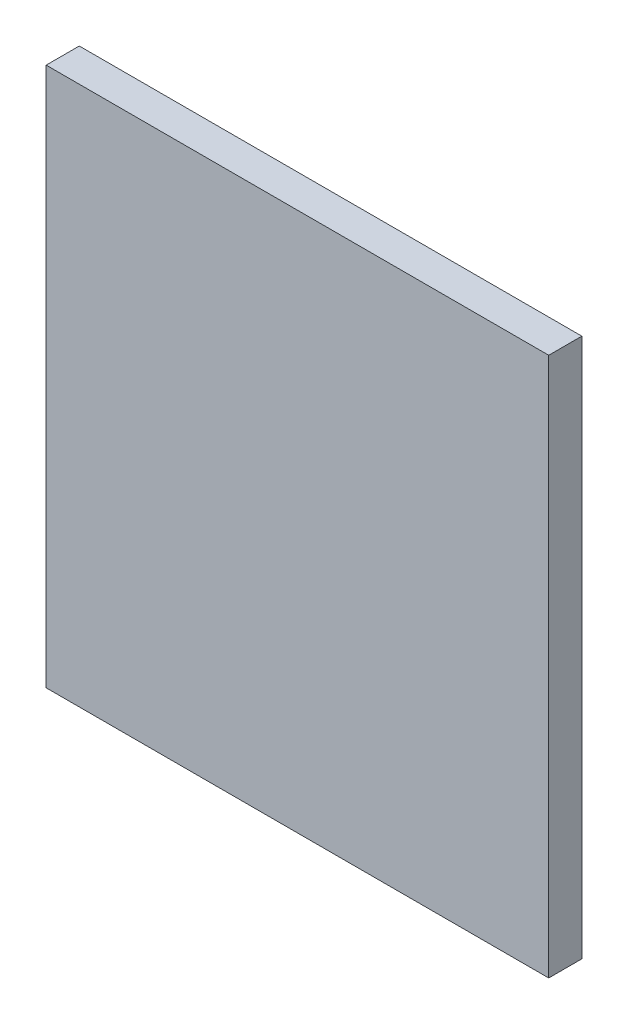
from build123d import *

# Parameters (mm, degrees)
ESQUISSE1_W        = 410
ESQUISSE1_H        = 440
BOSS_EXTRU_1_DEPTH = 27


with BuildPart() as part:
    # Esquisse1 → Boss.-Extru.1 (new body)
    with BuildSketch(Plane.XY):
        with Locations((205, 260)):
            Rectangle(ESQUISSE1_W, ESQUISSE1_H)
    extrude(amount=-BOSS_EXTRU_1_DEPTH)


solid = part.part
